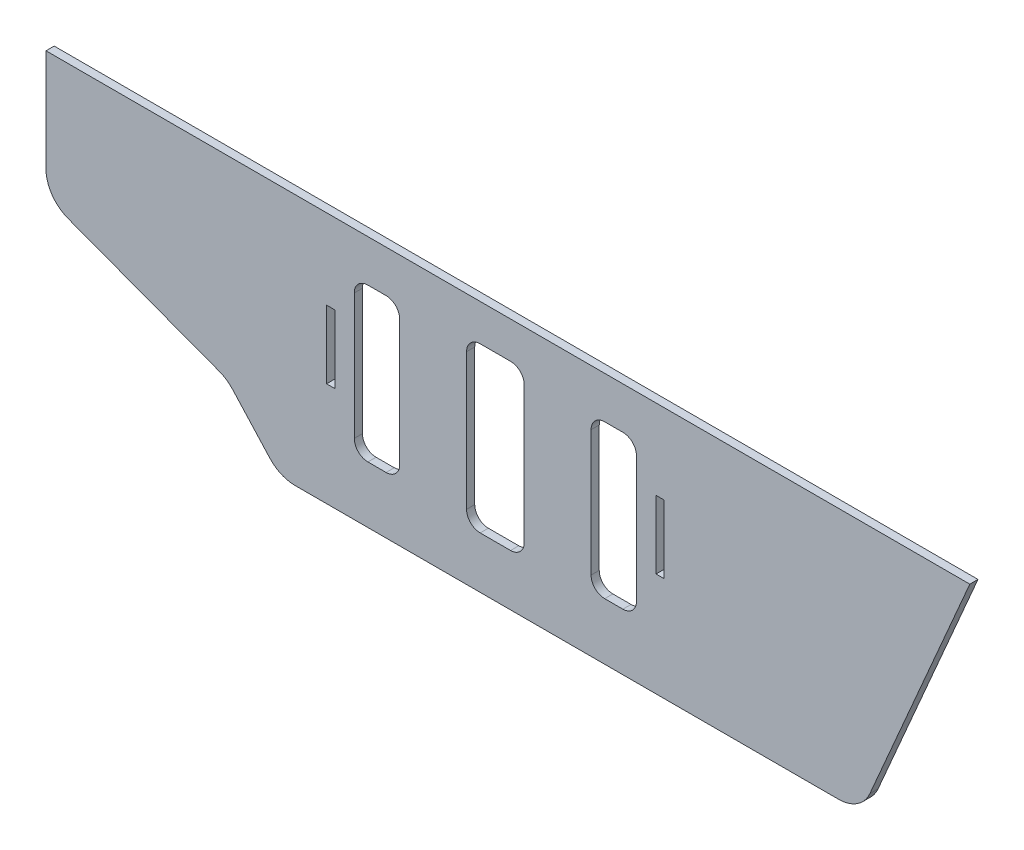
from build123d import *

# Parameters (mm, degrees)
SKETCH1_W           = 1.524
SKETCH1_H           = 12.7
BOSS_EXTRUDE1_DEPTH = 1.524


with BuildPart() as part:
    # Sketch1 → Boss-Extrude1 (new body)
    with BuildSketch(Plane.XY):
        with BuildLine():
            Line((-115.235325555, 38.553033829), (56.968580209, 38.553033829))
            Line((56.968580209, 38.553033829), (38.335766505, -4.582258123))
            ThreePointArc((38.335766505, -4.582258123), (35.994406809, -7.370418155), (32.506376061, -8.41418206))
            Line((32.506376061, -8.41418206), (-68.823962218, -8.41418206))
            ThreePointArc((-68.823962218, -8.41418206), (-71.390285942, -7.872493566), (-73.518767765, -6.339845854))
            Line((-73.518767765, -6.339845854), (-80.461176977, 1.283125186))
            ThreePointArc((-80.461176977, 1.283125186), (-81.594463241, 2.264654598), (-82.926282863, 2.953126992))
            Line((-82.926282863, 2.953126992), (-111.115025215, 13.524261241))
            ThreePointArc((-111.115025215, 13.524261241), (-114.104573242, 15.853028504), (-115.235325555, 19.469926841))
            Line((-115.235325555, 19.469926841), (-115.235325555, 38.553033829))
        make_face()
        with Locations((-62.170947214, 17.292097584)):
            Rectangle(SKETCH1_W, SKETCH1_H, mode=Mode.SUBTRACT)
        with Locations((-0.762, 17.292097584)):
            Rectangle(SKETCH1_W, SKETCH1_H, mode=Mode.SUBTRACT)
        with BuildLine():
            Line((-55.23379038, 30.724521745), (-51.840376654, 30.724521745))
            ThreePointArc((-51.840376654, 30.724521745), (-50.04432543, 29.980572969), (-49.300376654, 28.184521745))
            Line((-49.300376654, 28.184521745), (-49.300376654, 4.717187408))
            ThreePointArc((-49.300376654, 4.717187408), (-50.04432543, 2.921136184), (-51.840376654, 2.177187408))
            Line((-51.840376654, 2.177187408), (-55.23379038, 2.177187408))
            ThreePointArc((-55.23379038, 2.177187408), (-57.029841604, 2.921136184), (-57.77379038, 4.717187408))
            Line((-57.77379038, 4.717187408), (-57.77379038, 28.184521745))
            ThreePointArc((-57.77379038, 28.184521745), (-57.029841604, 29.980572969), (-55.23379038, 30.724521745))
        make_face(mode=Mode.SUBTRACT)
        with BuildLine():
            Line((-13.632570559, 28.184521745), (-13.632570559, 4.717187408))
            ThreePointArc((-13.632570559, 4.717187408), (-12.888621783, 2.921136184), (-11.092570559, 2.177187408))
            Line((-11.092570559, 2.177187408), (-7.699156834, 2.177187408))
            ThreePointArc((-7.699156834, 2.177187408), (-5.90310561, 2.921136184), (-5.159156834, 4.717187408))
            Line((-5.159156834, 4.717187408), (-5.159156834, 28.184521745))
            ThreePointArc((-5.159156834, 28.184521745), (-5.90310561, 29.980572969), (-7.699156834, 30.724521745))
            Line((-7.699156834, 30.724521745), (-11.092570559, 30.724521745))
            ThreePointArc((-11.092570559, 30.724521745), (-12.888621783, 29.980572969), (-13.632570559, 28.184521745))
        make_face(mode=Mode.SUBTRACT)
        with BuildLine():
            Line((-34.302835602, 1.185758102), (-28.630111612, 1.185758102))
            ThreePointArc((-28.630111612, 1.185758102), (-26.834060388, 1.929706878), (-26.090111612, 3.725758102))
            Line((-26.090111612, 3.725758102), (-26.090111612, 29.175951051))
            ThreePointArc((-26.090111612, 29.175951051), (-26.834060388, 30.972002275), (-28.630111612, 31.715951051))
            Line((-28.630111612, 31.715951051), (-34.302835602, 31.715951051))
            ThreePointArc((-34.302835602, 31.715951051), (-36.098886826, 30.972002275), (-36.842835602, 29.175951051))
            Line((-36.842835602, 29.175951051), (-36.842835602, 3.725758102))
            ThreePointArc((-36.842835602, 3.725758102), (-36.098886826, 1.929706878), (-34.302835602, 1.185758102))
        make_face(mode=Mode.SUBTRACT)
    extrude(amount=BOSS_EXTRUDE1_DEPTH)


solid = part.part
